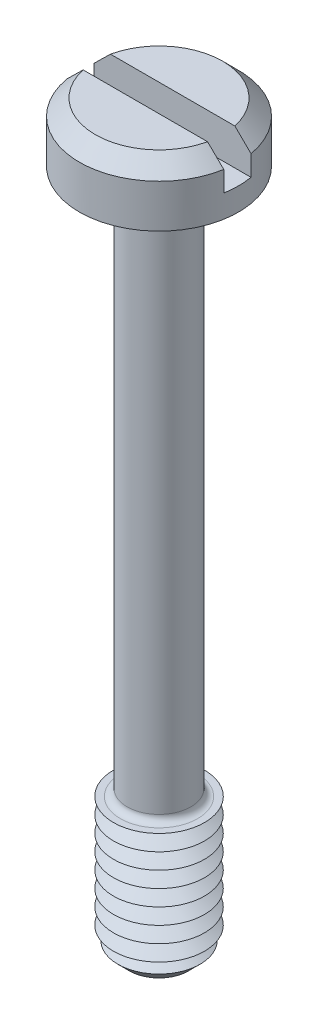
from build123d import *

# Parameters (mm, degrees)
SKETCH1_R           = 3.5
BOSS_EXTRUDE1_DEPTH = 2.6
SKETCH2_R           = 1.4
BOSS_EXTRUDE2_DEPTH = 30
SKETCH3_R           = 2
BOSS_EXTRUDE3_DEPTH = 6
CHAMFER1_SIZE       = 0.7
LPATTERN1_COUNT     = 8
LPATTERN1_PITCH     = 0.7
FILLET1_R           = 0.3
CHAMFER2_SIZE       = 0.7
SKETCH6_W           = 7
SKETCH6_H           = 1.2
CUT_EXTRUDE1_DEPTH  = 1.6


with BuildPart() as part:
    # Sketch1 → Boss-Extrude1 (new body)
    with BuildSketch(Plane(origin=(0, 0, 0), x_dir=(1, 0, 0), z_dir=(0, 1, 0))):
        with Locations(Location((0, 0, 0), (0, 0, 270))):
            Circle(SKETCH1_R)
    extrude(amount=BOSS_EXTRUDE1_DEPTH)

    # Sketch2 → Boss-Extrude2 (add)
    with BuildSketch(Plane.XZ):
        with Locations(Location((0, 0, 0), (0, 0, 270))):
            Circle(SKETCH2_R)
    extrude(amount=BOSS_EXTRUDE2_DEPTH)

    # Sketch3 → Boss-Extrude3 (add)
    with BuildSketch(Plane.XZ.offset(30)):
        with Locations(Location((0, 0, 0), (0, 0, 270))):
            Circle(SKETCH3_R)
    extrude(amount=-BOSS_EXTRUDE3_DEPTH)

    # Chamfer1
    chamfer1_edges = [part.edges().sort_by_distance(p)[0] for p in [
        (0, -30, 2),
    ]]
    chamfer(chamfer1_edges, length=CHAMFER1_SIZE)

    # Sketch5 → Cut-Revolve1 (revolve, cut)
    with BuildSketch(Plane(origin=(0, 0, 0), x_dir=(0, 0, -1), z_dir=(1, 0, 0))):
        Polygon((-2, -24), (-1.393782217, -24.35), (-2, -24.7), align=None)
    cut_revolve1 = revolve(axis=Axis((0, -6.58711856, 0), (0, -1, 0)), mode=Mode.SUBTRACT)

    # LPattern1: Cut-Revolve1 ×8
    with Locations(*[(0, -i * LPATTERN1_PITCH, 0) for i in range(1, LPATTERN1_COUNT)]):
        add(cut_revolve1, mode=Mode.SUBTRACT)

    # Fillet1
    fillet1_edges = [part.edges().sort_by_distance(p)[0] for p in [
        (0, 0, 1.4),
        (0, -24, 1.4),
    ]]
    fillet(fillet1_edges, radius=FILLET1_R)

    # Chamfer2
    chamfer2_edges = [part.edges().sort_by_distance(p)[0] for p in [
        (0, 2.6, -3.5),
    ]]
    chamfer(chamfer2_edges, length=CHAMFER2_SIZE)

    # Sketch6 → Cut-Extrude1 (cut)
    with BuildSketch(Plane(origin=(0, 2.6, 0), x_dir=(1, 0, 0), z_dir=(0, 1, 0))):
        Rectangle(SKETCH6_W, SKETCH6_H)
    extrude(amount=-CUT_EXTRUDE1_DEPTH, mode=Mode.SUBTRACT)


solid = part.part
